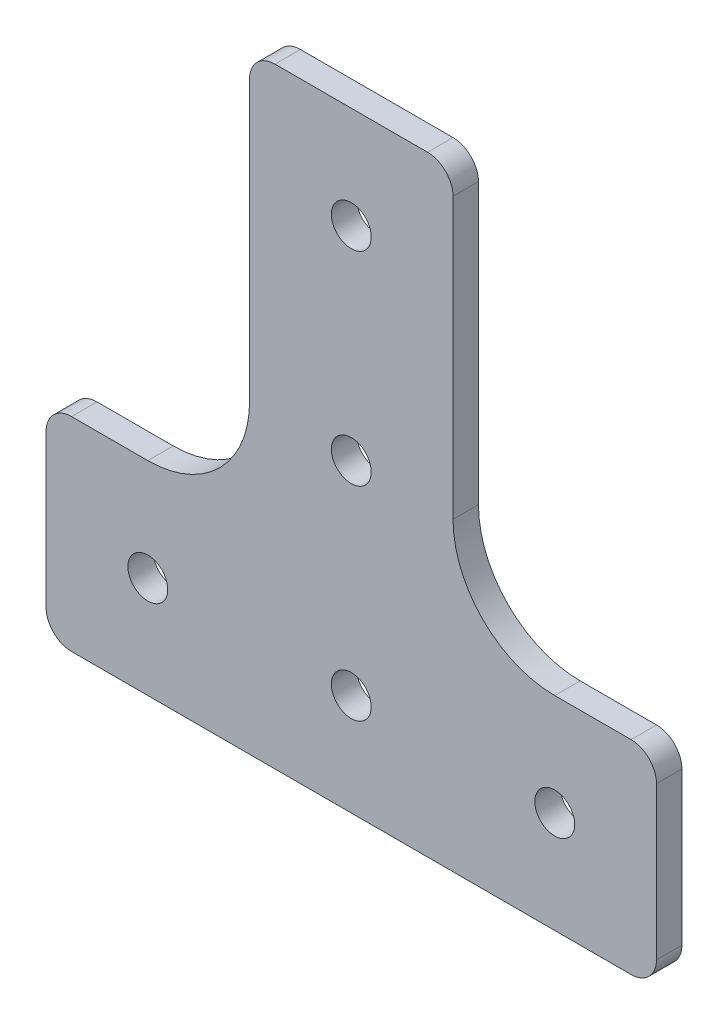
from build123d import *

# Parameters (mm, degrees)
BOSS_EXTRUDE1_DEPTH = 3.175
FILLET1_R           = 3.175
FILLET2_R           = 12.7
SKETCH2_R           = 2.4892
CUT_EXTRUDE1_DEPTH  = 86.253332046


with BuildPart() as part:
    # Sketch1 → Boss-Extrude1 (new body)
    with BuildSketch(Plane.XY):
        Polygon((-38.1, 0), (38.1, 0), (38.1, 25.4), (12.7, 25.4), (12.7, 76.2), (-12.7, 76.2), (-12.7, 25.4), (-38.1, 25.4), align=None)
    extrude(amount=BOSS_EXTRUDE1_DEPTH)

    # Fillet1
    fillet1_edges = [part.edges().sort_by_distance(p)[0] for p in [
        (-38.1, 25.4, 1.5875),
        (-12.7, 76.2, 1.5875),
        (12.7, 76.2, 1.5875),
        (38.1, 25.4, 1.5875),
        (38.1, 0, 1.5875),
        (-38.1, 0, 1.5875),
    ]]
    fillet(fillet1_edges, radius=FILLET1_R)

    # Fillet2
    fillet2_edges = [part.edges().sort_by_distance(p)[0] for p in [
        (-12.7, 25.4, 1.5875),
        (12.7, 25.4, 1.5875),
    ]]
    fillet(fillet2_edges, radius=FILLET2_R)

    # Sketch2 → Cut-Extrude1 (cut, through all)
    with BuildSketch(Plane.XY.offset(3.175)):
        with Locations((0, 12.7)):
            Circle(SKETCH2_R)
        with Locations((25.4, 12.7)):
            Circle(SKETCH2_R)
        with Locations((-25.4, 12.7)):
            Circle(SKETCH2_R)
        with Locations((0, 38.1)):
            Circle(SKETCH2_R)
        with Locations((0, 63.5)):
            Circle(SKETCH2_R)
    extrude(amount=-CUT_EXTRUDE1_DEPTH, mode=Mode.SUBTRACT)


solid = part.part
